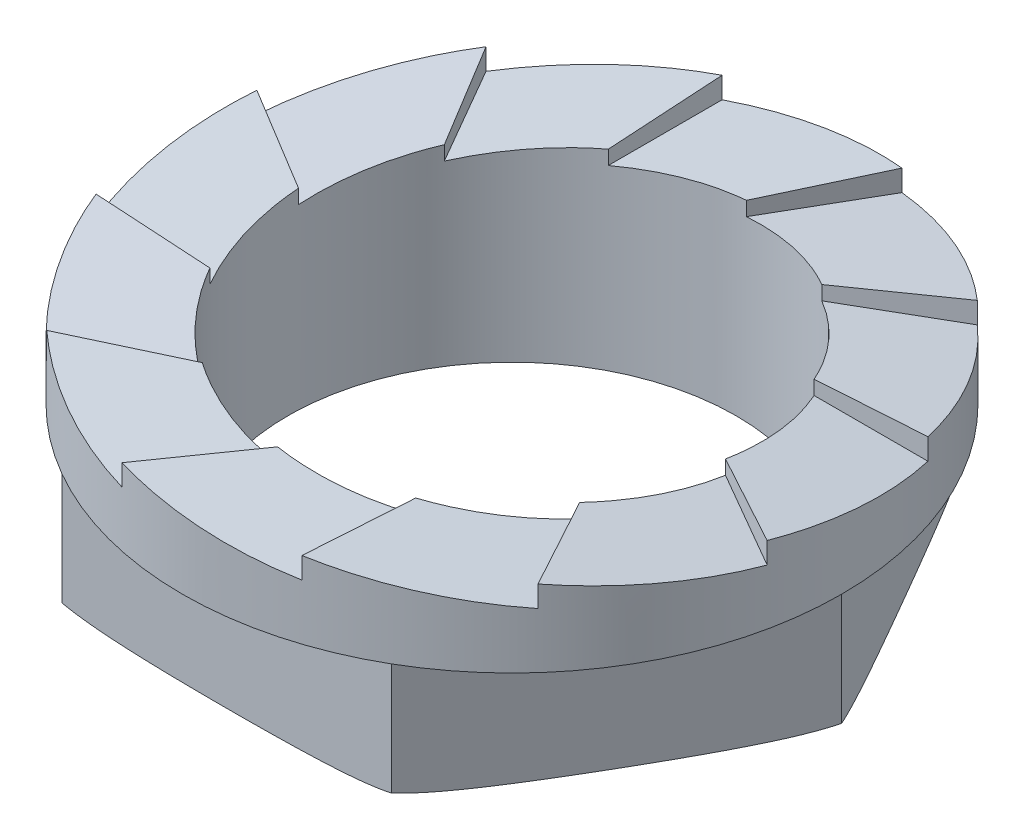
from build123d import *

# Parameters (mm, degrees)
BOSS_EXTRU_1_DEPTH           = 3
ESQUISSE2_R                  = 8.082903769
BOSS_EXTRU_2_DEPTH           = 2
ESQUISSE3_R                  = 5.5
ENL_V_MAT_EXTRU_1_DEPTH      = 13.476644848
ENL_V_MAT_EXTRU_2_DEPTH      = 13.476644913
R_P_TITION_CIRCULAIRE1_COUNT = 12


with BuildPart() as part:
    # Esquisse1 → Boss.-Extru.1 (new body)
    with BuildSketch(Plane(origin=(0, 0, 0), x_dir=(1, 0, 0), z_dir=(0, 1, 0))):
        Polygon((8.082903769, 0), (4.041451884, 7), (-4.041451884, 7), (-8.082903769, 0), (-4.041451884, -7), (4.041451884, -7), align=None)
    extrude(amount=BOSS_EXTRU_1_DEPTH)

    # Esquisse2 → Boss.-Extru.2 (add)
    with BuildSketch(Plane(origin=(0, 3, 0), x_dir=(1, 0, 0), z_dir=(0, 1, 0))):
        with Locations(Location((0, 0, 0), (0, 0, 60))):
            Circle(ESQUISSE2_R)
    extrude(amount=BOSS_EXTRU_2_DEPTH)

    # Esquisse3 → Enl_v. mat.-Extru.1 (cut, through all)
    with BuildSketch(Plane.XZ):
        with Locations(Location((0, 0, 0), (0, 0, 270))):
            Circle(ESQUISSE3_R)
    extrude(amount=-ENL_V_MAT_EXTRU_1_DEPTH, mode=Mode.SUBTRACT)

    # Esquisse4 → Enl_vement de mati_re-R_volution1 (revolve, cut)
    with BuildSketch(Plane(origin=(0, 0, 0), x_dir=(0, 0, -1), z_dir=(1, 0, 0))):
        with BuildLine():
            Line((-8.300275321, 0.380388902), (-8.530670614, 0.380388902))
            Line((-8.530670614, 0.380388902), (-8.530670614, -0.293516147))
            Line((-8.530670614, -0.293516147), (-5.978539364, -0.293516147))
            Line((-5.978539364, -0.293516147), (-5.978539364, 0))
            add(Edge.make_bspline(
                [(-5.978539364, 0), (-7.234027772, 0.003925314), (-7.953518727, 0.115913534), (-8.300275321, 0.380388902)],
                knots=[0, 0, 0, 0, 1, 1, 1, 1], degree=3))
        make_face()
    revolve(axis=Axis((0, 6.620487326, 0), (0, -1, 0)), mode=Mode.SUBTRACT)

    # Esquisse6 → Enl_v. mat.-Extru.2 (cut, through all)
    with BuildSketch(Plane.XY):
        Polygon((2.586962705, 5), (-2.524284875, 4.362177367), (-2.524284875, 5.984340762), (2.586962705, 5.984340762), align=None)
    enl_v_mat_extru_2 = extrude(amount=-ENL_V_MAT_EXTRU_2_DEPTH, mode=Mode.SUBTRACT)

    # R_p_tition circulaire1: Enl_v. mat.-Extru.2 ×12 about axis
    r_p_tition_circulaire1_axis = Axis((0, 0, 0), (0, 1, 0))
    for i in range(1, R_P_TITION_CIRCULAIRE1_COUNT):
        add(enl_v_mat_extru_2.rotate(r_p_tition_circulaire1_axis, i * 360 / R_P_TITION_CIRCULAIRE1_COUNT), mode=Mode.SUBTRACT)


solid = part.part
